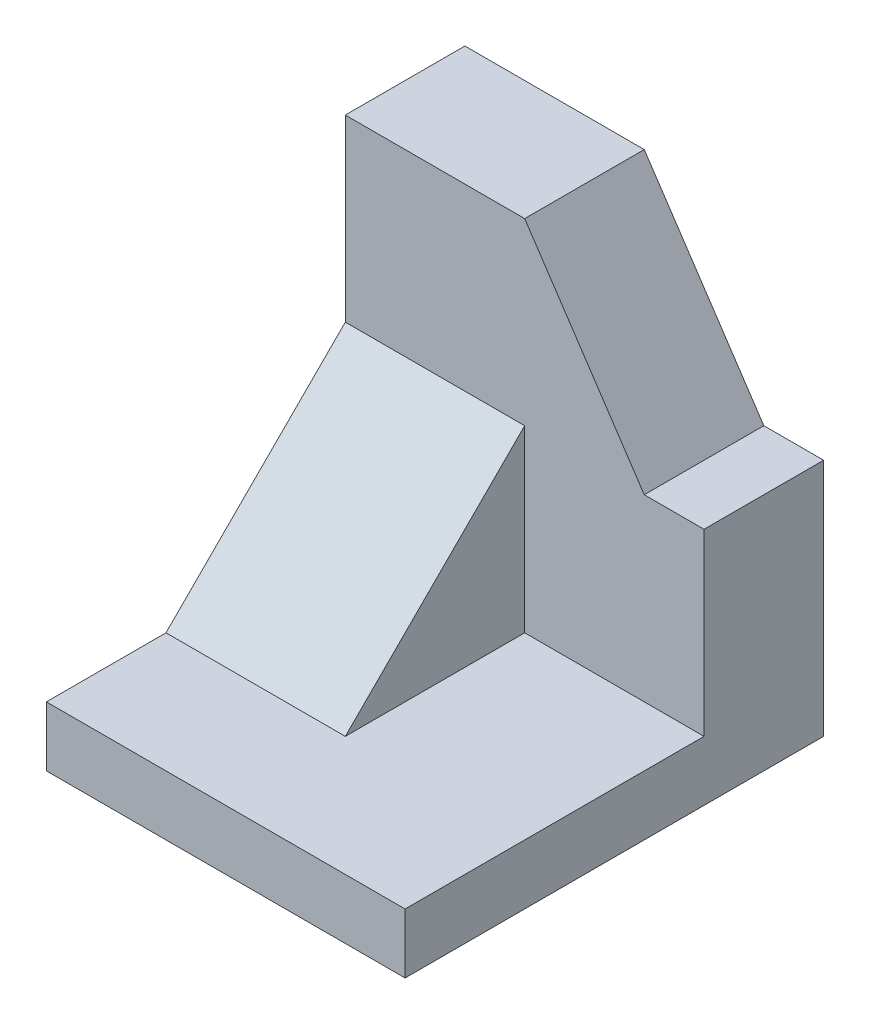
from build123d import *

# Parameters (mm, degrees)
CROQUIS1_W              = 60
CROQUIS1_H              = 70
SALIENTE_EXTRUIR1_DEPTH = 35
CORTAR_EXTRUIR1_DEPTH   = 58.879184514
CROQUIS3_W              = 50
CROQUIS3_H              = 60
CORTAR_EXTRUIR2_DEPTH   = 58.879184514
CORTAR_EXTRUIR3_DEPTH   = 84.815273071


with BuildPart() as part:
    # Croquis1 → Saliente-Extruir1 (new, symmetric)
    with BuildSketch(Plane.XY):
        Rectangle(CROQUIS1_W, CROQUIS1_H)
    extrude(amount=SALIENTE_EXTRUIR1_DEPTH, both=True)

    # Croquis2 → Cortar-Extruir1 (cut, through all)
    with BuildSketch(Plane(origin=(0, 0, 0), x_dir=(0, 0, -1), z_dir=(1, 0, 0))):
        Polygon((-35, -25), (-15, -25), (15, 5), (15, 35), (-35, 35), align=None)
    extrude(amount=-CORTAR_EXTRUIR1_DEPTH, mode=Mode.SUBTRACT)

    # Croquis3 → Cortar-Extruir2 (cut, through all)
    with BuildSketch(Plane.ZY):
        with Locations((10, 5)):
            Rectangle(CROQUIS3_W, CROQUIS3_H)
    extrude(amount=-CORTAR_EXTRUIR2_DEPTH, mode=Mode.SUBTRACT)

    # Croquis4 → Cortar-Extruir3 (cut, through all)
    with BuildSketch(Plane(origin=(0, 0, -35), x_dir=(-1, 0, 0), z_dir=(0, 0, -1))):
        Polygon((0, 35), (-20, 5), (-30, 5), (-30, 35), align=None)
    extrude(amount=-CORTAR_EXTRUIR3_DEPTH, mode=Mode.SUBTRACT)


solid = part.part
